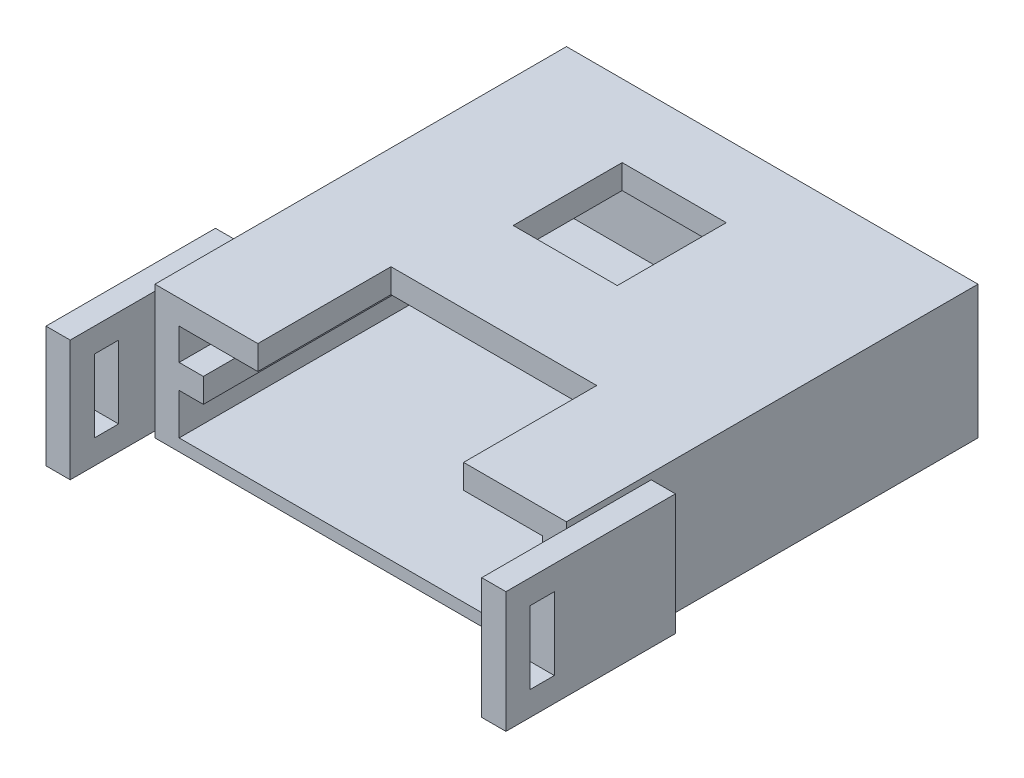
from build123d import *

# Parameters (mm, degrees)
SKETCH1_W           = 15
SKETCH1_H           = 16
BOSS_EXTRUDE2_DEPTH = 0.5
BOSS_EXTRUDE3_DEPTH = 5.5
SKETCH3_W           = 17
SKETCH3_H           = 17
BOSS_EXTRUDE4_DEPTH = 1
SKETCH4_W           = 8.5
SKETCH4_H           = 11
CUT_EXTRUDE1_DEPTH  = 1
SKETCH5_W           = 1
SKETCH5_H           = 1
BOSS_EXTRUDE5_DEPTH = 17
SKETCH6_W           = 4.3
SKETCH6_H           = 4.5
CUT_EXTRUDE2_DEPTH  = 1
SKETCH7_W           = 7
SKETCH7_H           = 5
SKETCH7_W_2         = 1
SKETCH7_H_2         = 3
BOSS_EXTRUDE6_DEPTH = 1
SKETCH8_W           = 7
SKETCH8_H           = 5
SKETCH8_W_2         = 1
SKETCH8_H_2         = 3
BOSS_EXTRUDE7_DEPTH = 1


with BuildPart() as part:
    # Sketch1 → Boss-Extrude2 (new body)
    with BuildSketch(Plane(origin=(0, 0, 0), x_dir=(1, 0, 0), z_dir=(0, 1, 0))):
        Rectangle(SKETCH1_W, SKETCH1_H)
    extrude(amount=BOSS_EXTRUDE2_DEPTH)

    # Sketch2 → Boss-Extrude3 (add)
    with BuildSketch(Plane.XZ):
        Polygon((8.5, 8), (7.5, 8), (7.5, -8), (-7.5, -8), (-7.5, 8), (-8.5, 8), (-8.5, -9), (8.5, -9), align=None)
    extrude(amount=-BOSS_EXTRUDE3_DEPTH)

    # Sketch3 → Boss-Extrude4 (add)
    with BuildSketch(Plane(origin=(0, 5.5, 0), x_dir=(1, 0, 0), z_dir=(0, 1, 0))):
        with Locations((0, 0.5)):
            Rectangle(SKETCH3_W, SKETCH3_H)
    extrude(amount=-BOSS_EXTRUDE4_DEPTH)

    # Sketch4 → Cut-Extrude1 (cut)
    with BuildSketch(Plane(origin=(0, 5.5, 0), x_dir=(1, 0, 0), z_dir=(0, 1, 0))):
        with Locations((0, -8)):
            Rectangle(SKETCH4_W, SKETCH4_H)
    extrude(amount=-CUT_EXTRUDE1_DEPTH, mode=Mode.SUBTRACT)

    # Sketch5 → Boss-Extrude5 (add)
    with BuildSketch(Plane.XY.offset(8)):
        with Locations((-7, 2.7)):
            Rectangle(SKETCH5_W, SKETCH5_H)
        with Locations((7, 2.7)):
            Rectangle(SKETCH5_W, SKETCH5_H)
    extrude(amount=-BOSS_EXTRUDE5_DEPTH)

    # Sketch6 → Cut-Extrude2 (cut)
    with BuildSketch(Plane(origin=(0, 5.5, 0), x_dir=(1, 0, 0), z_dir=(0, 1, 0))):
        with Locations((-1.05, 3.75)):
            Rectangle(SKETCH6_W, SKETCH6_H)
    extrude(amount=-CUT_EXTRUDE2_DEPTH, mode=Mode.SUBTRACT)

    # Sketch7 → Boss-Extrude6 (add)
    with BuildSketch(Plane(origin=(8.5, 0, 0), x_dir=(0, 0, -1), z_dir=(1, 0, 0))):
        with Locations((-8, 2.75)):
            Rectangle(SKETCH7_W, SKETCH7_H)
        with Locations((-10, 2.75)):
            Rectangle(SKETCH7_W_2, SKETCH7_H_2, mode=Mode.SUBTRACT)
    extrude(amount=BOSS_EXTRUDE6_DEPTH)

    # Sketch8 → Boss-Extrude7 (add)
    with BuildSketch(Plane.ZY.offset(8.5)):
        with Locations((8, 2.75)):
            Rectangle(SKETCH8_W, SKETCH8_H)
        with Locations((10, 2.75)):
            Rectangle(SKETCH8_W_2, SKETCH8_H_2, mode=Mode.SUBTRACT)
    extrude(amount=BOSS_EXTRUDE7_DEPTH)


solid = part.part
